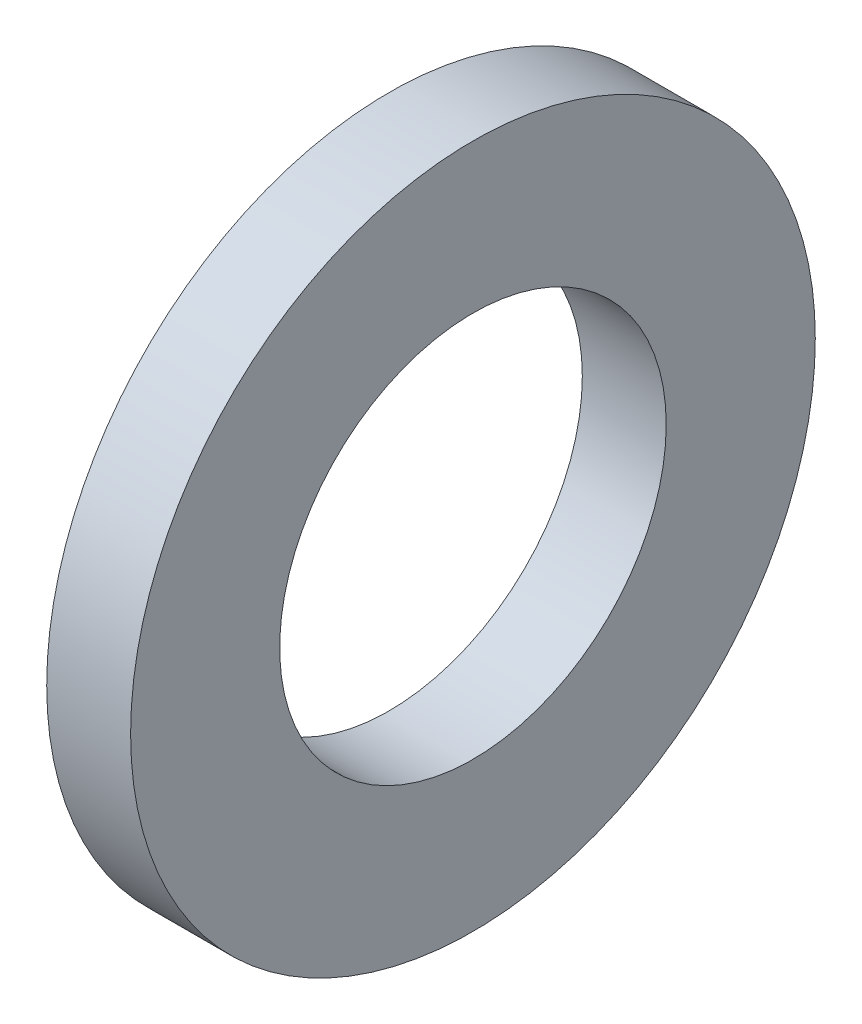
ISO-10303-21;
HEADER;
FILE_DESCRIPTION(('STEP AP214'),'2;1');
FILE_NAME('part.step','',(''),(''),'','','');
FILE_SCHEMA(('AUTOMOTIVE_DESIGN { 1 0 10303 214 1 1 1 1 }'));
ENDSEC;
DATA;
#1=APPLICATION_CONTEXT('core data for automotive mechanical design processes');
#2=APPLICATION_PROTOCOL_DEFINITION('international standard','automotive_design',2000,#1);
#3=PRODUCT_CONTEXT('',#1,'mechanical');
#4=PRODUCT('Part','Part','',(#3));
#5=PRODUCT_RELATED_PRODUCT_CATEGORY('part','',(#4));
#6=PRODUCT_DEFINITION_FORMATION('','',#4);
#7=PRODUCT_DEFINITION_CONTEXT('part definition',#1,'design');
#8=PRODUCT_DEFINITION('design','',#6,#7);
#9=PRODUCT_DEFINITION_SHAPE('','',#8);
#10=(LENGTH_UNIT() NAMED_UNIT(*) SI_UNIT(.MILLI.,.METRE.));
#11=(NAMED_UNIT(*) PLANE_ANGLE_UNIT() SI_UNIT($,.RADIAN.));
#12=(NAMED_UNIT(*) SI_UNIT($,.STERADIAN.) SOLID_ANGLE_UNIT());
#13=UNCERTAINTY_MEASURE_WITH_UNIT(LENGTH_MEASURE(1.E-05),#10,'distance_accuracy_value','');
#14=(GEOMETRIC_REPRESENTATION_CONTEXT(3) GLOBAL_UNCERTAINTY_ASSIGNED_CONTEXT((#13)) GLOBAL_UNIT_ASSIGNED_CONTEXT((#10,
#11,#12)) REPRESENTATION_CONTEXT('',''));
#15=CARTESIAN_POINT('',(0.,0.,0.));
#16=DIRECTION('',(0.,0.,1.));
#17=DIRECTION('',(1.,0.,0.));
#18=AXIS2_PLACEMENT_3D('',#15,#16,#17);
#19=CARTESIAN_POINT('',(1.4224,0.,0.));
#20=DIRECTION('',(1.,0.,0.));
#21=DIRECTION('',(0.,0.,-1.));
#22=AXIS2_PLACEMENT_3D('',#19,#20,#21);
#23=PLANE('',#22);
#24=CARTESIAN_POINT('',(1.4224,0.,0.));
#25=DIRECTION('',(1.,0.,0.));
#26=DIRECTION('',(0.,0.,-1.));
#27=AXIS2_PLACEMENT_3D('',#24,#25,#26);
#28=CIRCLE('',#27,5.8039);
#29=CARTESIAN_POINT('',(1.4224,0.,-5.8039));
#30=VERTEX_POINT('',#29);
#31=EDGE_CURVE('E10',#30,#30,#28,.T.);
#32=ORIENTED_EDGE('',*,*,#31,.T.);
#33=EDGE_LOOP('',(#32));
#34=FACE_BOUND('',#33,.T.);
#35=CARTESIAN_POINT('',(1.4224,0.,0.));
#36=DIRECTION('',(1.,0.,0.));
#37=DIRECTION('',(0.,0.,-1.));
#38=AXIS2_PLACEMENT_3D('',#35,#36,#37);
#39=CIRCLE('',#38,3.2766);
#40=CARTESIAN_POINT('',(1.4224,0.,-3.2766));
#41=VERTEX_POINT('',#40);
#42=EDGE_CURVE('E43',#41,#41,#39,.T.);
#43=ORIENTED_EDGE('',*,*,#42,.F.);
#44=EDGE_LOOP('',(#43));
#45=FACE_BOUND('',#44,.T.);
#46=ADVANCED_FACE('F32',(#34,#45),#23,.T.);
#47=CARTESIAN_POINT('',(0.,0.,0.));
#48=DIRECTION('',(1.,0.,0.));
#49=DIRECTION('',(0.,0.,-1.));
#50=AXIS2_PLACEMENT_3D('',#47,#48,#49);
#51=PLANE('',#50);
#52=CARTESIAN_POINT('',(0.,0.,0.));
#53=DIRECTION('',(1.,0.,0.));
#54=DIRECTION('',(0.,0.,-1.));
#55=AXIS2_PLACEMENT_3D('',#52,#53,#54);
#56=CIRCLE('',#55,5.8039);
#57=CARTESIAN_POINT('',(0.,0.,-5.8039));
#58=VERTEX_POINT('',#57);
#59=EDGE_CURVE('E36',#58,#58,#56,.T.);
#60=ORIENTED_EDGE('',*,*,#59,.F.);
#61=EDGE_LOOP('',(#60));
#62=FACE_BOUND('',#61,.T.);
#63=CARTESIAN_POINT('',(0.,0.,0.));
#64=DIRECTION('',(1.,0.,0.));
#65=DIRECTION('',(0.,0.,-1.));
#66=AXIS2_PLACEMENT_3D('',#63,#64,#65);
#67=CIRCLE('',#66,3.2766);
#68=CARTESIAN_POINT('',(0.,0.,-3.2766));
#69=VERTEX_POINT('',#68);
#70=EDGE_CURVE('E45',#69,#69,#67,.T.);
#71=ORIENTED_EDGE('',*,*,#70,.T.);
#72=EDGE_LOOP('',(#71));
#73=FACE_BOUND('',#72,.T.);
#74=ADVANCED_FACE('F55',(#62,#73),#51,.F.);
#75=CARTESIAN_POINT('',(1.4224,0.,0.));
#76=DIRECTION('',(-1.,0.,0.));
#77=DIRECTION('',(0.,0.,1.));
#78=AXIS2_PLACEMENT_3D('',#75,#76,#77);
#79=CYLINDRICAL_SURFACE('',#78,5.8039);
#80=ORIENTED_EDGE('',*,*,#31,.F.);
#81=EDGE_LOOP('',(#80));
#82=FACE_BOUND('',#81,.T.);
#83=ORIENTED_EDGE('',*,*,#59,.T.);
#84=EDGE_LOOP('',(#83));
#85=FACE_BOUND('',#84,.T.);
#86=ADVANCED_FACE('F34',(#82,#85),#79,.T.);
#87=CARTESIAN_POINT('',(1.4224,0.,0.));
#88=DIRECTION('',(-1.,0.,0.));
#89=DIRECTION('',(0.,0.,1.));
#90=AXIS2_PLACEMENT_3D('',#87,#88,#89);
#91=CYLINDRICAL_SURFACE('',#90,3.2766);
#92=ORIENTED_EDGE('',*,*,#42,.T.);
#93=EDGE_LOOP('',(#92));
#94=FACE_BOUND('',#93,.T.);
#95=ORIENTED_EDGE('',*,*,#70,.F.);
#96=EDGE_LOOP('',(#95));
#97=FACE_BOUND('',#96,.T.);
#98=ADVANCED_FACE('F51',(#94,#97),#91,.F.);
#99=CLOSED_SHELL('',(#46,#74,#86,#98));
#100=MANIFOLD_SOLID_BREP('B2',#99);
#101=ADVANCED_BREP_SHAPE_REPRESENTATION('',(#18,#100),#14);
#102=SHAPE_DEFINITION_REPRESENTATION(#9,#101);
ENDSEC;
END-ISO-10303-21;
